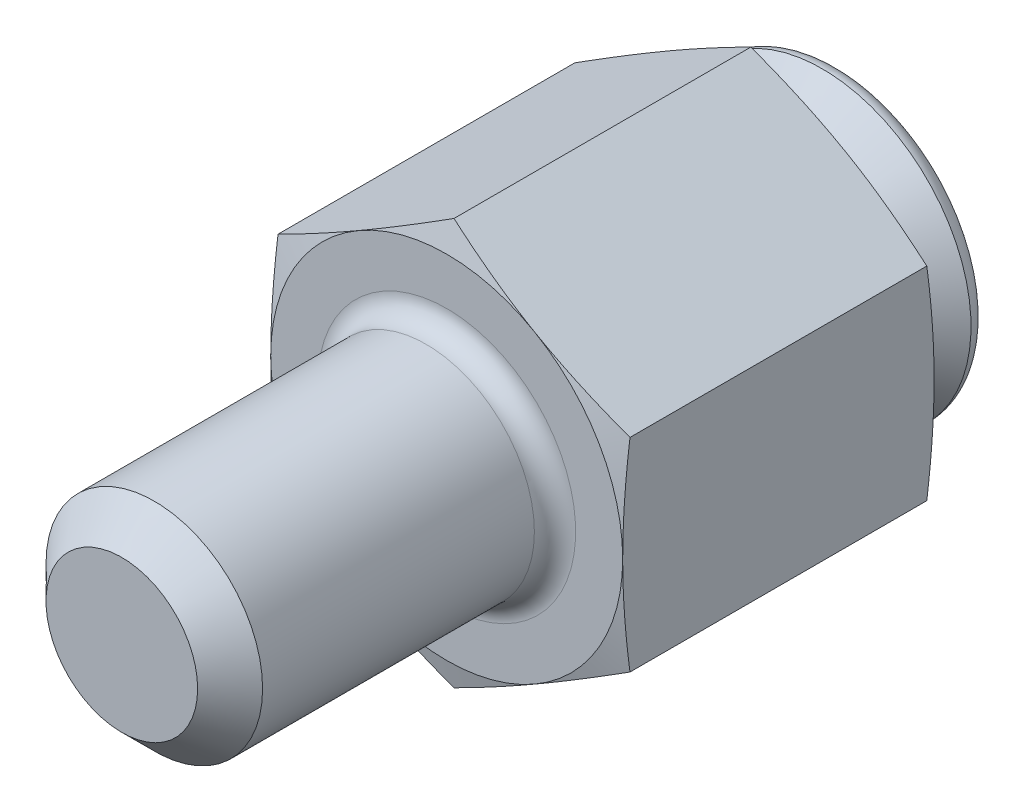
ISO-10303-21;
HEADER;
FILE_DESCRIPTION(('STEP AP214'),'2;1');
FILE_NAME('part.step','',(''),(''),'','','');
FILE_SCHEMA(('AUTOMOTIVE_DESIGN { 1 0 10303 214 1 1 1 1 }'));
ENDSEC;
DATA;
#1=APPLICATION_CONTEXT('core data for automotive mechanical design processes');
#2=APPLICATION_PROTOCOL_DEFINITION('international standard','automotive_design',2000,#1);
#3=PRODUCT_CONTEXT('',#1,'mechanical');
#4=PRODUCT('Part','Part','',(#3));
#5=PRODUCT_RELATED_PRODUCT_CATEGORY('part','',(#4));
#6=PRODUCT_DEFINITION_FORMATION('','',#4);
#7=PRODUCT_DEFINITION_CONTEXT('part definition',#1,'design');
#8=PRODUCT_DEFINITION('design','',#6,#7);
#9=PRODUCT_DEFINITION_SHAPE('','',#8);
#10=(LENGTH_UNIT() NAMED_UNIT(*) SI_UNIT(.MILLI.,.METRE.));
#11=(NAMED_UNIT(*) PLANE_ANGLE_UNIT() SI_UNIT($,.RADIAN.));
#12=(NAMED_UNIT(*) SI_UNIT($,.STERADIAN.) SOLID_ANGLE_UNIT());
#13=UNCERTAINTY_MEASURE_WITH_UNIT(LENGTH_MEASURE(1.E-05),#10,'distance_accuracy_value','');
#14=(GEOMETRIC_REPRESENTATION_CONTEXT(3) GLOBAL_UNCERTAINTY_ASSIGNED_CONTEXT((#13)) GLOBAL_UNIT_ASSIGNED_CONTEXT((#10,
#11,#12)) REPRESENTATION_CONTEXT('',''));
#15=CARTESIAN_POINT('',(0.,0.,0.));
#16=DIRECTION('',(0.,0.,1.));
#17=DIRECTION('',(1.,0.,0.));
#18=AXIS2_PLACEMENT_3D('',#15,#16,#17);
#19=CARTESIAN_POINT('',(0.,0.,6.5013999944));
#20=DIRECTION('',(0.,0.,-1.));
#21=DIRECTION('',(-0.250229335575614,0.968186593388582,0.));
#22=AXIS2_PLACEMENT_3D('',#19,#20,#21);
#23=SPHERICAL_SURFACE('',#22,5.);
#24=CARTESIAN_POINT('',(0.,0.,4.2191999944));
#25=DIRECTION('',(0.,0.,-1.));
#26=DIRECTION('',(-0.968186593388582,-0.250229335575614,0.));
#27=AXIS2_PLACEMENT_3D('',#24,#25,#26);
#28=CIRCLE('',#27,4.44877097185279);
#29=CARTESIAN_POINT('',(-1.1132130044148,4.30724041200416,4.2191999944));
#30=VERTEX_POINT('',#29);
#31=EDGE_CURVE('E9',#30,#30,#28,.F.);
#32=CARTESIAN_POINT('',(0.,0.,3.56696480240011));
#33=DIRECTION('',(0.,0.,1.));
#34=DIRECTION('',(-0.250229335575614,0.968186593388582,0.));
#35=AXIS2_PLACEMENT_3D('',#32,#33,#34);
#36=CIRCLE('',#35,4.04834411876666);
#37=CARTESIAN_POINT('',(-1.01301445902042,3.91955250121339,3.56696480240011));
#38=VERTEX_POINT('',#37);
#39=EDGE_CURVE('E280',#38,#38,#36,.T.);
#40=CARTESIAN_POINT('',(-1.1132130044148,4.30724041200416,4.2191999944));
#41=CARTESIAN_POINT('',(-1.11230155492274,4.30371383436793,4.21209962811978));
#42=CARTESIAN_POINT('',(-1.11138585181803,4.30017079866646,4.20500798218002));
#43=CARTESIAN_POINT('',(-1.10954595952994,4.29305189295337,4.19084229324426));
#44=CARTESIAN_POINT('',(-1.10862177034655,4.28947602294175,4.18376825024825));
#45=CARTESIAN_POINT('',(-1.10676492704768,4.2822915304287,4.16963792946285));
#46=CARTESIAN_POINT('',(-1.1058322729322,4.27868290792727,4.16258165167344));
#47=CARTESIAN_POINT('',(-1.10395852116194,4.27143299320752,4.14848702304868));
#48=CARTESIAN_POINT('',(-1.10301742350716,4.26779170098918,4.14144867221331));
#49=CARTESIAN_POINT('',(-1.10112680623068,4.26047653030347,4.12739005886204));
#50=CARTESIAN_POINT('',(-1.10017728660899,4.25680265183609,4.12036979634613));
#51=CARTESIAN_POINT('',(-1.09826984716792,4.24942239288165,4.10634752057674));
#52=CARTESIAN_POINT('',(-1.09731192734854,4.24571601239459,4.09934550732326));
#53=CARTESIAN_POINT('',(-1.09538770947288,4.23827083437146,4.08535989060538));
#54=CARTESIAN_POINT('',(-1.09442141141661,4.23453203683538,4.07837628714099));
#55=CARTESIAN_POINT('',(-1.0924804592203,4.22702211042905,4.06442765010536));
#56=CARTESIAN_POINT('',(-1.09150580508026,4.22325098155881,4.05746261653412));
#57=CARTESIAN_POINT('',(-1.08954816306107,4.21567647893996,4.04355127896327));
#58=CARTESIAN_POINT('',(-1.08856517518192,4.21187310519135,4.03660497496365));
#59=CARTESIAN_POINT('',(-1.08659088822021,4.2042342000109,4.0227312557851));
#60=CARTESIAN_POINT('',(-1.08559958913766,4.20039866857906,4.01580384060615));
#61=CARTESIAN_POINT('',(-1.08360870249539,4.19269553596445,4.00196805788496));
#62=CARTESIAN_POINT('',(-1.08260911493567,4.1888279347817,3.99505969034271));
#63=CARTESIAN_POINT('',(-1.08060167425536,4.18106075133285,3.98126216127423));
#64=CARTESIAN_POINT('',(-1.07959382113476,4.17716116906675,3.97437299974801));
#65=CARTESIAN_POINT('',(-1.07756987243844,4.16933011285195,3.96061404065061));
#66=CARTESIAN_POINT('',(-1.07655377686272,4.16539863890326,3.95374424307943));
#67=CARTESIAN_POINT('',(-1.07451336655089,4.15750388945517,3.94002416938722));
#68=CARTESIAN_POINT('',(-1.07348905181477,4.15354061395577,3.93317389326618));
#69=CARTESIAN_POINT('',(-1.0714322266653,4.14558235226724,3.91949301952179));
#70=CARTESIAN_POINT('',(-1.07039971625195,4.14158736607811,3.91266242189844));
#71=CARTESIAN_POINT('',(-1.06832652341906,4.13356577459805,3.89902106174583));
#72=CARTESIAN_POINT('',(-1.06728584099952,4.12953916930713,3.89221029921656));
#73=CARTESIAN_POINT('',(-1.06519632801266,4.12145443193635,3.8786087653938));
#74=CARTESIAN_POINT('',(-1.06414749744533,4.11739629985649,3.8718179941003));
#75=CARTESIAN_POINT('',(-1.0620417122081,4.10924860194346,3.8582565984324));
#76=CARTESIAN_POINT('',(-1.06098475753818,4.10515903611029,3.85148597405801));
#77=CARTESIAN_POINT('',(-1.05886274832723,4.09694856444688,3.83796502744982));
#78=CARTESIAN_POINT('',(-1.05779769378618,4.09282765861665,3.83121470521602));
#79=CARTESIAN_POINT('',(-1.0556595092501,4.08455460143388,3.81773451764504));
#80=CARTESIAN_POINT('',(-1.05458637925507,4.08040245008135,3.81100465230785));
#81=CARTESIAN_POINT('',(-1.0524320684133,4.07206699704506,3.79756553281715));
#82=CARTESIAN_POINT('',(-1.05135088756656,4.06788369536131,3.79085627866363));
#83=CARTESIAN_POINT('',(-1.04918049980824,4.0594860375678,3.77745853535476));
#84=CARTESIAN_POINT('',(-1.04809129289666,4.05527168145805,3.77077004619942));
#85=CARTESIAN_POINT('',(-1.0459048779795,4.04681201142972,3.75741398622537));
#86=CARTESIAN_POINT('',(-1.04480766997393,4.04256669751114,3.75074641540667));
#87=CARTESIAN_POINT('',(-1.04260527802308,4.03404520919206,3.7374323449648));
#88=CARTESIAN_POINT('',(-1.0415000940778,4.02976903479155,3.73078584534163));
#89=CARTESIAN_POINT('',(-1.03928177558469,4.021185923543,3.71751406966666));
#90=CARTESIAN_POINT('',(-1.03816864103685,4.01687898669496,3.71088879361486));
#91=CARTESIAN_POINT('',(-1.03593444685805,4.00823444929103,3.69765961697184));
#92=CARTESIAN_POINT('',(-1.03481338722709,4.00389684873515,3.69105571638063));
#93=CARTESIAN_POINT('',(-1.03256336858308,3.99519108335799,3.67786944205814));
#94=CARTESIAN_POINT('',(-1.03143440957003,3.99082291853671,3.67128706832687));
#95=CARTESIAN_POINT('',(-1.02916861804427,3.98205612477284,3.65814399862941));
#96=CARTESIAN_POINT('',(-1.02803178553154,3.97765749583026,3.65158330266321));
#97=CARTESIAN_POINT('',(-1.0257502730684,3.96882987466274,3.63848373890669));
#98=CARTESIAN_POINT('',(-1.02460559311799,3.96440088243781,3.63194487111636));
#99=CARTESIAN_POINT('',(-1.02230841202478,3.95551263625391,3.61888911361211));
#100=CARTESIAN_POINT('',(-1.02115591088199,3.95105338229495,3.61237222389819));
#101=CARTESIAN_POINT('',(-1.01884311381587,3.94210471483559,3.59936057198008));
#102=CARTESIAN_POINT('',(-1.01768281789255,3.93761530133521,3.5928658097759));
#103=CARTESIAN_POINT('',(-1.01535445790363,3.92860641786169,3.57989856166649));
#104=CARTESIAN_POINT('',(-1.01418639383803,3.92408694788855,3.57342607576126));
#105=CARTESIAN_POINT('',(-1.01301445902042,3.91955250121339,3.56696480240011));
#106=B_SPLINE_CURVE_WITH_KNOTS('',3,(#40,#41,#42,#43,#44,#45,#46,#47,#48,#49,#50,#51,#52,#53,
#54,#55,#56,#57,#58,#59,#60,#61,#62,#63,#64,#65,#66,#67,#68,#69,#70,#71,#72,#73,#74,#75,#76,#77,
#78,#79,#80,#81,#82,#83,#84,#85,#86,#87,#88,#89,#90,#91,#92,#93,#94,#95,#96,#97,#98,#99,#100,
#101,#102,#103,#104,#105),.UNSPECIFIED.,.F.,.F.,(4,2,2,2,2,2,2,2,2,2,2,2,2,2,2,2,2,2,2,2,2,2,2,
2,2,2,2,2,2,2,2,2,4),(0.,0.0239404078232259,0.0478808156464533,0.0718212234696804,
0.0957616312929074,0.119702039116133,0.14364244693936,0.167582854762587,0.191523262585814,
0.21546367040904,0.239404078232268,0.263344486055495,0.287284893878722,0.311225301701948,
0.335165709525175,0.359106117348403,0.383046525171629,0.406986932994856,0.430927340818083,
0.454867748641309,0.478808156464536,0.502748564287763,0.52668897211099,0.550629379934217,
0.574569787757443,0.59851019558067,0.622450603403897,0.646391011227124,0.67033141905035,
0.694271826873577,0.718212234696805,0.742152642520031,0.766093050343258),.UNSPECIFIED.);
#107=EDGE_CURVE('BSEAM14',#30,#38,#106,.T.);
#108=ORIENTED_EDGE('',*,*,#31,.F.);
#109=ORIENTED_EDGE('',*,*,#39,.T.);
#110=ORIENTED_EDGE('',*,*,#107,.T.);
#111=ORIENTED_EDGE('',*,*,#107,.F.);
#112=EDGE_LOOP('',(#108,#110,#109,#111));
#113=FACE_BOUND('',#112,.T.);
#114=ADVANCED_FACE('F14',(#113),#23,.T.);
#115=CARTESIAN_POINT('',(0.,0.,0.));
#116=DIRECTION('',(0.,0.,-1.));
#117=DIRECTION('',(0.250229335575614,-0.968186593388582,0.));
#118=AXIS2_PLACEMENT_3D('',#115,#116,#117);
#119=CYLINDRICAL_SURFACE('',#118,4.);
#120=CARTESIAN_POINT('',(0.,0.,3.41789549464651));
#121=DIRECTION('',(0.,0.,1.));
#122=DIRECTION('',(-0.250229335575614,0.968186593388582,0.));
#123=AXIS2_PLACEMENT_3D('',#120,#121,#122);
#124=CIRCLE('',#123,4.);
#125=CARTESIAN_POINT('',(-1.00091734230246,3.87274637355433,3.41789549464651));
#126=VERTEX_POINT('',#125);
#127=EDGE_CURVE('E278',#126,#126,#124,.F.);
#128=ORIENTED_EDGE('',*,*,#127,.T.);
#129=EDGE_LOOP('',(#128));
#130=FACE_BOUND('',#129,.T.);
#131=CARTESIAN_POINT('',(0.,0.,2.24021024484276));
#132=DIRECTION('',(0.,0.,-1.));
#133=DIRECTION('',(0.250229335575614,-0.968186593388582,0.));
#134=AXIS2_PLACEMENT_3D('',#131,#132,#133);
#135=CIRCLE('',#134,4.);
#136=CARTESIAN_POINT('',(1.00091734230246,-3.87274637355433,2.24021024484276));
#137=VERTEX_POINT('',#136);
#138=EDGE_CURVE('E275',#137,#137,#135,.F.);
#139=ORIENTED_EDGE('',*,*,#138,.T.);
#140=EDGE_LOOP('',(#139));
#141=FACE_BOUND('',#140,.T.);
#142=ADVANCED_FACE('F299',(#130,#141),#119,.T.);
#143=CARTESIAN_POINT('',(0.,0.,2.135));
#144=DIRECTION('',(0.,0.,-1.));
#145=DIRECTION('',(0.250229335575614,-0.968186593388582,0.));
#146=AXIS2_PLACEMENT_3D('',#143,#144,#145);
#147=CONICAL_SURFACE('',#146,4.,0.78539816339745);
#148=CARTESIAN_POINT('',(0.,0.,2.06060512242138));
#149=DIRECTION('',(0.,0.,-1.));
#150=DIRECTION('',(0.250229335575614,-0.968186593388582,0.));
#151=AXIS2_PLACEMENT_3D('',#148,#149,#150);
#152=CIRCLE('',#151,4.07439487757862);
#153=CARTESIAN_POINT('',(1.01953312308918,-3.94477449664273,2.06060512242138));
#154=VERTEX_POINT('',#153);
#155=EDGE_CURVE('E18',#154,#154,#152,.T.);
#156=ORIENTED_EDGE('',*,*,#155,.T.);
#157=EDGE_LOOP('',(#156));
#158=FACE_BOUND('',#157,.T.);
#159=CARTESIAN_POINT('',(0.,0.,0.635));
#160=DIRECTION('',(0.,0.,-1.));
#161=DIRECTION('',(0.250229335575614,-0.968186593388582,0.));
#162=AXIS2_PLACEMENT_3D('',#159,#160,#161);
#163=CIRCLE('',#162,5.5);
#164=CARTESIAN_POINT('',(1.37626134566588,-5.3250262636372,0.635));
#165=VERTEX_POINT('',#164);
#166=EDGE_CURVE('E269',#165,#165,#163,.T.);
#167=ORIENTED_EDGE('',*,*,#166,.F.);
#168=EDGE_LOOP('',(#167));
#169=FACE_BOUND('',#168,.T.);
#170=ADVANCED_FACE('F305',(#158,#169),#147,.T.);
#171=CARTESIAN_POINT('',(-1.37626134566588,5.3250262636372,0.));
#172=DIRECTION('',(0.,0.,1.));
#173=DIRECTION('',(-0.250229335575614,0.968186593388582,0.));
#174=AXIS2_PLACEMENT_3D('',#171,#172,#173);
#175=PLANE('',#174);
#176=CARTESIAN_POINT('',(0.,0.,0.));
#177=DIRECTION('',(0.,0.,1.));
#178=DIRECTION('',(-0.250229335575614,0.968186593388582,0.));
#179=AXIS2_PLACEMENT_3D('',#176,#177,#178);
#180=CIRCLE('',#179,4.865);
#181=CARTESIAN_POINT('',(-1.21736571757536,4.71022777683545,0.));
#182=VERTEX_POINT('',#181);
#183=EDGE_CURVE('E272',#182,#182,#180,.F.);
#184=ORIENTED_EDGE('',*,*,#183,.T.);
#185=EDGE_LOOP('',(#184));
#186=FACE_BOUND('',#185,.T.);
#187=ADVANCED_FACE('F347',(#186),#175,.F.);
#188=CARTESIAN_POINT('',(0.,0.,0.635));
#189=DIRECTION('',(0.,0.,1.));
#190=DIRECTION('',(-0.250229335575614,0.968186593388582,0.));
#191=AXIS2_PLACEMENT_3D('',#188,#189,#190);
#192=TOROIDAL_SURFACE('',#191,4.865,0.635);
#193=ORIENTED_EDGE('',*,*,#166,.T.);
#194=EDGE_LOOP('',(#193));
#195=FACE_BOUND('',#194,.T.);
#196=ORIENTED_EDGE('',*,*,#183,.F.);
#197=EDGE_LOOP('',(#196));
#198=FACE_BOUND('',#197,.T.);
#199=ADVANCED_FACE('F350',(#195,#198),#192,.T.);
#200=CARTESIAN_POINT('',(0.,0.,3.41789549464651));
#201=DIRECTION('',(0.,0.,1.));
#202=DIRECTION('',(-0.250229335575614,0.968186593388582,0.));
#203=AXIS2_PLACEMENT_3D('',#200,#201,#202);
#204=TOROIDAL_SURFACE('',#203,4.254,0.254);
#205=ORIENTED_EDGE('',*,*,#39,.F.);
#206=EDGE_LOOP('',(#205));
#207=FACE_BOUND('',#206,.T.);
#208=ORIENTED_EDGE('',*,*,#127,.F.);
#209=EDGE_LOOP('',(#208));
#210=FACE_BOUND('',#209,.T.);
#211=ADVANCED_FACE('F321',(#207,#210),#204,.F.);
#212=CARTESIAN_POINT('',(0.,0.,2.24021024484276));
#213=DIRECTION('',(0.,0.,-1.));
#214=DIRECTION('',(0.250229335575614,-0.968186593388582,0.));
#215=AXIS2_PLACEMENT_3D('',#212,#213,#214);
#216=TOROIDAL_SURFACE('',#215,4.254,0.254);
#217=ORIENTED_EDGE('',*,*,#138,.F.);
#218=EDGE_LOOP('',(#217));
#219=FACE_BOUND('',#218,.T.);
#220=ORIENTED_EDGE('',*,*,#155,.F.);
#221=EDGE_LOOP('',(#220));
#222=FACE_BOUND('',#221,.T.);
#223=ADVANCED_FACE('F16',(#219,#222),#216,.F.);
#224=CARTESIAN_POINT('',(0.,0.,26.4999999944));
#225=DIRECTION('',(0.,0.,1.));
#226=DIRECTION('',(1.,0.,0.));
#227=AXIS2_PLACEMENT_3D('',#224,#225,#226);
#228=PLANE('',#227);
#229=CARTESIAN_POINT('',(0.,0.,26.4999999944));
#230=DIRECTION('',(0.,0.,1.));
#231=DIRECTION('',(1.,0.,0.));
#232=AXIS2_PLACEMENT_3D('',#229,#230,#231);
#233=CIRCLE('',#232,2.8);
#234=CARTESIAN_POINT('',(2.8,0.,26.4999999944));
#235=VERTEX_POINT('',#234);
#236=EDGE_CURVE('E264',#235,#235,#233,.T.);
#237=ORIENTED_EDGE('',*,*,#236,.T.);
#238=EDGE_LOOP('',(#237));
#239=FACE_BOUND('',#238,.T.);
#240=ADVANCED_FACE('F309',(#239),#228,.T.);
#241=CARTESIAN_POINT('',(0.,0.,26.4999999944));
#242=DIRECTION('',(0.,0.,-1.));
#243=DIRECTION('',(-1.,0.,0.));
#244=AXIS2_PLACEMENT_3D('',#241,#242,#243);
#245=CONICAL_SURFACE('',#244,2.8,0.785398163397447);
#246=CARTESIAN_POINT('',(0.,0.,25.2999999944));
#247=DIRECTION('',(0.,0.,1.));
#248=DIRECTION('',(1.,0.,0.));
#249=AXIS2_PLACEMENT_3D('',#246,#247,#248);
#250=CIRCLE('',#249,4.);
#251=CARTESIAN_POINT('',(4.,0.,25.2999999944));
#252=VERTEX_POINT('',#251);
#253=EDGE_CURVE('E23',#252,#252,#250,.F.);
#254=ORIENTED_EDGE('',*,*,#253,.F.);
#255=EDGE_LOOP('',(#254));
#256=FACE_BOUND('',#255,.T.);
#257=ORIENTED_EDGE('',*,*,#236,.F.);
#258=EDGE_LOOP('',(#257));
#259=FACE_BOUND('',#258,.T.);
#260=ADVANCED_FACE('F311',(#256,#259),#245,.T.);
#261=CARTESIAN_POINT('',(0.,0.,26.4999999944));
#262=DIRECTION('',(0.,0.,-1.));
#263=DIRECTION('',(-1.,0.,0.));
#264=AXIS2_PLACEMENT_3D('',#261,#262,#263);
#265=CYLINDRICAL_SURFACE('',#264,4.);
#266=ORIENTED_EDGE('',*,*,#253,.T.);
#267=EDGE_LOOP('',(#266));
#268=FACE_BOUND('',#267,.T.);
#269=CARTESIAN_POINT('',(0.,0.,15.2619999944));
#270=DIRECTION('',(0.,0.,-1.));
#271=DIRECTION('',(-1.,0.,0.));
#272=AXIS2_PLACEMENT_3D('',#269,#270,#271);
#273=CIRCLE('',#272,4.);
#274=CARTESIAN_POINT('',(-4.,0.,15.2619999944));
#275=VERTEX_POINT('',#274);
#276=EDGE_CURVE('E258',#275,#275,#273,.F.);
#277=ORIENTED_EDGE('',*,*,#276,.T.);
#278=EDGE_LOOP('',(#277));
#279=FACE_BOUND('',#278,.T.);
#280=ADVANCED_FACE('F318',(#268,#279),#265,.T.);
#281=CARTESIAN_POINT('',(0.,0.,15.2619999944));
#282=DIRECTION('',(0.,0.,-1.));
#283=DIRECTION('',(-1.,0.,0.));
#284=AXIS2_PLACEMENT_3D('',#281,#282,#283);
#285=TOROIDAL_SURFACE('',#284,4.762,0.762);
#286=CARTESIAN_POINT('',(0.,0.,14.4999999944));
#287=DIRECTION('',(0.,0.,-1.));
#288=DIRECTION('',(-1.,0.,0.));
#289=AXIS2_PLACEMENT_3D('',#286,#287,#288);
#290=CIRCLE('',#289,4.762);
#291=CARTESIAN_POINT('',(-4.762,0.,14.4999999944));
#292=VERTEX_POINT('',#291);
#293=EDGE_CURVE('E261',#292,#292,#290,.T.);
#294=ORIENTED_EDGE('',*,*,#293,.F.);
#295=EDGE_LOOP('',(#294));
#296=FACE_BOUND('',#295,.T.);
#297=ORIENTED_EDGE('',*,*,#276,.F.);
#298=EDGE_LOOP('',(#297));
#299=FACE_BOUND('',#298,.T.);
#300=ADVANCED_FACE('F324',(#296,#299),#285,.F.);
#301=CARTESIAN_POINT('',(-6.5,3.75277674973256,14.4999999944));
#302=DIRECTION('',(0.,0.,-1.));
#303=DIRECTION('',(-1.,0.,0.));
#304=AXIS2_PLACEMENT_3D('',#301,#302,#303);
#305=PLANE('',#304);
#306=CARTESIAN_POINT('',(0.,0.,14.4999999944));
#307=DIRECTION('',(0.,0.,-1.));
#308=DIRECTION('',(-1.,0.,0.));
#309=AXIS2_PLACEMENT_3D('',#306,#307,#308);
#310=CIRCLE('',#309,6.5);
#311=CARTESIAN_POINT('',(-6.5,0.,14.4999999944));
#312=VERTEX_POINT('',#311);
#313=CARTESIAN_POINT('',(-3.25,5.62916512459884,14.4999999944));
#314=VERTEX_POINT('',#313);
#315=EDGE_CURVE('E624',#312,#314,#310,.T.);
#316=ORIENTED_EDGE('',*,*,#315,.F.);
#317=CARTESIAN_POINT('',(0.,0.,14.4999999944));
#318=DIRECTION('',(0.,0.,-1.));
#319=DIRECTION('',(-1.,0.,0.));
#320=AXIS2_PLACEMENT_3D('',#317,#318,#319);
#321=CIRCLE('',#320,6.5);
#322=CARTESIAN_POINT('',(-3.25,-5.62916512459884,14.4999999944));
#323=VERTEX_POINT('',#322);
#324=EDGE_CURVE('E235',#323,#312,#321,.T.);
#325=ORIENTED_EDGE('',*,*,#324,.F.);
#326=CARTESIAN_POINT('',(3.25,-5.62916512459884,14.4999999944));
#327=VERTEX_POINT('',#326);
#328=EDGE_CURVE('E249',#327,#323,#321,.T.);
#329=ORIENTED_EDGE('',*,*,#328,.F.);
#330=CARTESIAN_POINT('',(6.5,0.,14.4999999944));
#331=VERTEX_POINT('',#330);
#332=EDGE_CURVE('E670',#331,#327,#321,.T.);
#333=ORIENTED_EDGE('',*,*,#332,.F.);
#334=CARTESIAN_POINT('',(3.25,5.62916512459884,14.4999999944));
#335=VERTEX_POINT('',#334);
#336=EDGE_CURVE('E672',#335,#331,#321,.T.);
#337=ORIENTED_EDGE('',*,*,#336,.F.);
#338=EDGE_CURVE('E250',#314,#335,#321,.T.);
#339=ORIENTED_EDGE('',*,*,#338,.F.);
#340=EDGE_LOOP('',(#316,#325,#329,#333,#337,#339));
#341=FACE_BOUND('',#340,.T.);
#342=ORIENTED_EDGE('',*,*,#293,.T.);
#343=EDGE_LOOP('',(#342));
#344=FACE_BOUND('',#343,.T.);
#345=ADVANCED_FACE('F329',(#341,#344),#305,.F.);
#346=CARTESIAN_POINT('',(0.,0.,13.0858363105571));
#347=DIRECTION('',(0.,0.,-1.));
#348=DIRECTION('',(-1.,0.,0.));
#349=AXIS2_PLACEMENT_3D('',#346,#347,#348);
#350=CONICAL_SURFACE('',#349,11.7777307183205,1.30899693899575);
#351=CARTESIAN_POINT('',(6.5,-10.0044654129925,13.0448738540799));
#352=CARTESIAN_POINT('',(6.50000000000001,-9.70867848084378,13.1113166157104));
#353=CARTESIAN_POINT('',(6.50000000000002,-9.41270865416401,13.1769595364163));
#354=CARTESIAN_POINT('',(6.50000000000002,-8.82031321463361,13.3062138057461));
#355=CARTESIAN_POINT('',(6.50000000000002,-8.523887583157,13.3698250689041));
#356=CARTESIAN_POINT('',(6.50000000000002,-7.9302364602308,13.4946371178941));
#357=CARTESIAN_POINT('',(6.50000000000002,-7.63301047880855,13.5558355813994));
#358=CARTESIAN_POINT('',(6.50000000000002,-7.03794541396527,13.6751737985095));
#359=CARTESIAN_POINT('',(6.50000000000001,-6.74010633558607,13.7333135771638));
#360=CARTESIAN_POINT('',(6.50000000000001,-6.14610081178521,13.84535276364));
#361=CARTESIAN_POINT('',(6.50000000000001,-5.8499401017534,13.8992824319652));
#362=CARTESIAN_POINT('',(6.50000000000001,-5.25681519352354,14.0025175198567));
#363=CARTESIAN_POINT('',(6.50000000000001,-4.95985101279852,14.0518230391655));
#364=CARTESIAN_POINT('',(6.50000000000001,-4.36505179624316,14.1447161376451));
#365=CARTESIAN_POINT('',(6.50000000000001,-4.06721684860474,14.1883042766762));
#366=CARTESIAN_POINT('',(6.50000000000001,-3.47059684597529,14.2684922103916));
#367=CARTESIAN_POINT('',(6.5,-3.17181178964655,14.3050919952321));
#368=CARTESIAN_POINT('',(6.5,-2.56988519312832,14.3702843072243));
#369=CARTESIAN_POINT('',(6.50000000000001,-2.26673301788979,14.3987800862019));
#370=CARTESIAN_POINT('',(6.50000000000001,-1.65965008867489,14.4458085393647));
#371=CARTESIAN_POINT('',(6.50000000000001,-1.3557193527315,14.46434144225));
#372=CARTESIAN_POINT('',(6.50000000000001,-0.747523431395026,14.4903642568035));
#373=CARTESIAN_POINT('',(6.50000000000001,-0.443258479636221,14.49785951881));
#374=CARTESIAN_POINT('',(6.50000000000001,0.165338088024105,14.5013445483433));
#375=CARTESIAN_POINT('',(6.50000000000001,0.469669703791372,14.4973343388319));
#376=CARTESIAN_POINT('',(6.5,1.07910960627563,14.4780322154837));
#377=CARTESIAN_POINT('',(6.5,1.3842165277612,14.4626980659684));
#378=CARTESIAN_POINT('',(6.5,1.99372315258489,14.421629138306));
#379=CARTESIAN_POINT('',(6.5,2.29812283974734,14.3958941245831));
#380=CARTESIAN_POINT('',(6.5,2.90621194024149,14.3353423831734));
#381=CARTESIAN_POINT('',(6.5,3.20990073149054,14.3005195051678));
#382=CARTESIAN_POINT('',(6.5,3.8162976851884,14.2232646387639));
#383=CARTESIAN_POINT('',(6.5,4.11900584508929,14.1808326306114));
#384=CARTESIAN_POINT('',(6.5,4.71530607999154,14.0909709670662));
#385=CARTESIAN_POINT('',(6.5,5.00892342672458,14.0437073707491));
#386=CARTESIAN_POINT('',(6.5,5.59535016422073,13.9443851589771));
#387=CARTESIAN_POINT('',(6.5,5.88815952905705,13.8923263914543));
#388=CARTESIAN_POINT('',(6.5,6.47308937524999,13.7843266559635));
#389=CARTESIAN_POINT('',(6.5,6.76520978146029,13.7283852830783));
#390=CARTESIAN_POINT('',(6.49999999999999,7.3488323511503,13.6133576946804));
#391=CARTESIAN_POINT('',(6.49999999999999,7.64033450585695,13.5542714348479));
#392=CARTESIAN_POINT('',(6.49999999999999,8.51421406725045,13.3731782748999));
#393=CARTESIAN_POINT('',(6.49999999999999,9.0958022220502,13.2473677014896));
#394=CARTESIAN_POINT('',(6.49999999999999,10.2574156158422,12.9889787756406));
#395=CARTESIAN_POINT('',(6.49999999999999,10.8374409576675,12.8564008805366));
#396=CARTESIAN_POINT('',(6.49999999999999,11.9903925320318,12.5879282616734));
#397=CARTESIAN_POINT('',(6.49999999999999,12.5633300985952,12.452082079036));
#398=CARTESIAN_POINT('',(6.49999999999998,13.7084200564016,12.1770780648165));
#399=CARTESIAN_POINT('',(6.49999999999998,14.2805724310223,12.0379201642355));
#400=CARTESIAN_POINT('',(6.49999999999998,15.4235044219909,11.7573669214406));
#401=CARTESIAN_POINT('',(6.49999999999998,15.9942848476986,11.6159748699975));
#402=CARTESIAN_POINT('',(6.49999999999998,17.1353614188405,11.3313338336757));
#403=CARTESIAN_POINT('',(6.49999999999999,17.7056575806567,11.1880849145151));
#404=CARTESIAN_POINT('',(6.5,18.2757873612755,11.0441847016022));
#405=B_SPLINE_CURVE_WITH_KNOTS('',3,(#351,#352,#353,#354,#355,#356,#357,#358,#359,#360,#361,
#362,#363,#364,#365,#366,#367,#368,#369,#370,#371,#372,#373,#374,#375,#376,#377,#378,#379,#380,
#381,#382,#383,#384,#385,#386,#387,#388,#389,#390,#391,#392,#393,#394,#395,#396,#397,#398,#399,
#400,#401,#402,#403,#404),.UNSPECIFIED.,.F.,.F.,(4,2,2,2,2,2,2,2,2,2,2,2,2,2,2,2,2,2,2,2,2,2,2,
2,2,2,4),(0.,0.909476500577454,1.81899120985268,2.72936096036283,3.63972325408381,
4.54278656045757,5.44583038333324,6.34878571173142,7.25174231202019,8.16506499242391,
9.07836670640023,9.991225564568,10.9040826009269,11.8203616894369,12.7366615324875,
13.6535831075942,14.5705070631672,15.4626502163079,16.3548216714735,17.2470863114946,
18.1393635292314,19.9244135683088,21.7093431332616,23.4757957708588,25.2422852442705,
27.0063787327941,28.7704099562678),.UNSPECIFIED.);
#406=CARTESIAN_POINT('',(6.5,-3.75277674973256,14.230562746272));
#407=VERTEX_POINT('',#406);
#408=EDGE_CURVE('E231',#331,#407,#405,.F.);
#409=ORIENTED_EDGE('',*,*,#408,.F.);
#410=ORIENTED_EDGE('',*,*,#332,.T.);
#411=CARTESIAN_POINT('',(6.5002,-3.75266127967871,14.2305318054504));
#412=CARTESIAN_POINT('',(6.23025475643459,-3.90851423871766,14.272310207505));
#413=CARTESIAN_POINT('',(5.95982006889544,-4.06464977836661,14.3102381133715));
#414=CARTESIAN_POINT('',(5.41799562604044,-4.37747226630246,14.3768739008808));
#415=CARTESIAN_POINT('',(5.14660552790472,-4.53415941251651,14.4055780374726));
#416=CARTESIAN_POINT('',(4.60451571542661,-4.84713511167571,14.4520905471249));
#417=CARTESIAN_POINT('',(4.33381966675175,-5.0034215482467,14.4699543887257));
#418=CARTESIAN_POINT('',(3.79208236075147,-5.31619372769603,14.4939079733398));
#419=CARTESIAN_POINT('',(3.52104118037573,-5.47267942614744,14.4999999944));
#420=CARTESIAN_POINT('',(2.97895881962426,-5.78565082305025,14.4999999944));
#421=CARTESIAN_POINT('',(2.70791763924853,-5.94213652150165,14.4939079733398));
#422=CARTESIAN_POINT('',(2.16618033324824,-6.25490870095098,14.4699543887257));
#423=CARTESIAN_POINT('',(1.89548428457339,-6.41119513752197,14.4520905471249));
#424=CARTESIAN_POINT('',(1.35339447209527,-6.72417083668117,14.4055780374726));
#425=CARTESIAN_POINT('',(1.08200437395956,-6.88085798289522,14.3768739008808));
#426=CARTESIAN_POINT('',(0.540179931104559,-7.19368047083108,14.3102381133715));
#427=CARTESIAN_POINT('',(0.269745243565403,-7.34981601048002,14.272310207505));
#428=CARTESIAN_POINT('',(-0.000200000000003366,-7.50566896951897,14.2305318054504));
#429=B_SPLINE_CURVE_WITH_KNOTS('',3,(#411,#412,#413,#414,#415,#416,#417,#418,#419,#420,#421,
#422,#423,#424,#425,#426,#427,#428),.UNSPECIFIED.,.F.,.F.,(4,2,2,2,2,2,2,2,4),(0.,
0.943529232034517,1.88744107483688,2.82648138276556,3.76533995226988,4.7041985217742,
5.64323882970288,6.58715067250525,7.53067990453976),.UNSPECIFIED.);
#430=EDGE_CURVE('E230',#407,#327,#429,.T.);
#431=ORIENTED_EDGE('',*,*,#430,.F.);
#432=EDGE_LOOP('',(#409,#410,#431));
#433=FACE_BOUND('',#432,.T.);
#434=ADVANCED_FACE('F341',(#433),#350,.T.);
#435=CARTESIAN_POINT('',(-0.000200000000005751,7.50566896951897,14.2305318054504));
#436=CARTESIAN_POINT('',(0.269745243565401,7.34981601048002,14.272310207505));
#437=CARTESIAN_POINT('',(0.540179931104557,7.19368047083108,14.3102381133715));
#438=CARTESIAN_POINT('',(1.08200437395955,6.88085798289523,14.3768739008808));
#439=CARTESIAN_POINT('',(1.35339447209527,6.72417083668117,14.4055780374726));
#440=CARTESIAN_POINT('',(1.89548428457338,6.41119513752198,14.4520905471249));
#441=CARTESIAN_POINT('',(2.16618033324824,6.25490870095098,14.4699543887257));
#442=CARTESIAN_POINT('',(2.70791763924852,5.94213652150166,14.4939079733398));
#443=CARTESIAN_POINT('',(2.97895881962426,5.78565082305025,14.4999999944));
#444=CARTESIAN_POINT('',(3.52104118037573,5.47267942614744,14.4999999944));
#445=CARTESIAN_POINT('',(3.79208236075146,5.31619372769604,14.4939079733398));
#446=CARTESIAN_POINT('',(4.33381966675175,5.00342154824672,14.4699543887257));
#447=CARTESIAN_POINT('',(4.6045157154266,4.84713511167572,14.4520905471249));
#448=CARTESIAN_POINT('',(5.14660552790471,4.53415941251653,14.4055780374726));
#449=CARTESIAN_POINT('',(5.41799562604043,4.37747226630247,14.3768739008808));
#450=CARTESIAN_POINT('',(5.95982006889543,4.06464977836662,14.3102381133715));
#451=CARTESIAN_POINT('',(6.23025475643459,3.90851423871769,14.272310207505));
#452=CARTESIAN_POINT('',(6.5002,3.75266127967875,14.2305318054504));
#453=B_SPLINE_CURVE_WITH_KNOTS('',3,(#435,#436,#437,#438,#439,#440,#441,#442,#443,#444,#445,
#446,#447,#448,#449,#450,#451,#452),.UNSPECIFIED.,.F.,.F.,(4,2,2,2,2,2,2,2,4),(0.,
0.943529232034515,1.88744107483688,2.82648138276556,3.76533995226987,4.70419852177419,
5.64323882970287,6.58715067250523,7.53067990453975),.UNSPECIFIED.);
#454=CARTESIAN_POINT('',(6.5,3.75277674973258,14.230562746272));
#455=VERTEX_POINT('',#454);
#456=EDGE_CURVE('E643',#335,#455,#453,.T.);
#457=ORIENTED_EDGE('',*,*,#456,.F.);
#458=ORIENTED_EDGE('',*,*,#336,.T.);
#459=EDGE_CURVE('E217',#455,#331,#405,.F.);
#460=ORIENTED_EDGE('',*,*,#459,.F.);
#461=EDGE_LOOP('',(#457,#458,#460));
#462=FACE_BOUND('',#461,.T.);
#463=ADVANCED_FACE('F418',(#462),#350,.T.);
#464=CARTESIAN_POINT('',(-6.5002,3.75266127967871,14.2305318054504));
#465=CARTESIAN_POINT('',(-6.23025475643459,3.90851423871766,14.272310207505));
#466=CARTESIAN_POINT('',(-5.95982006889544,4.06464977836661,14.3102381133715));
#467=CARTESIAN_POINT('',(-5.41799562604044,4.37747226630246,14.3768739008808));
#468=CARTESIAN_POINT('',(-5.14660552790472,4.53415941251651,14.4055780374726));
#469=CARTESIAN_POINT('',(-4.60451571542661,4.84713511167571,14.4520905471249));
#470=CARTESIAN_POINT('',(-4.33381966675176,5.0034215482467,14.4699543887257));
#471=CARTESIAN_POINT('',(-3.79208236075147,5.31619372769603,14.4939079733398));
#472=CARTESIAN_POINT('',(-3.52104118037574,5.47267942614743,14.4999999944));
#473=CARTESIAN_POINT('',(-2.97895881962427,5.78565082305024,14.4999999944));
#474=CARTESIAN_POINT('',(-2.70791763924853,5.94213652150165,14.4939079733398));
#475=CARTESIAN_POINT('',(-2.16618033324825,6.25490870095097,14.4699543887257));
#476=CARTESIAN_POINT('',(-1.89548428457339,6.41119513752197,14.4520905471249));
#477=CARTESIAN_POINT('',(-1.35339447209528,6.72417083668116,14.4055780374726));
#478=CARTESIAN_POINT('',(-1.08200437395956,6.88085798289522,14.3768739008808));
#479=CARTESIAN_POINT('',(-0.540179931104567,7.19368047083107,14.3102381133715));
#480=CARTESIAN_POINT('',(-0.269745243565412,7.34981601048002,14.272310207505));
#481=CARTESIAN_POINT('',(0.000199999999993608,7.50566896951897,14.2305318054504));
#482=B_SPLINE_CURVE_WITH_KNOTS('',3,(#464,#465,#466,#467,#468,#469,#470,#471,#472,#473,#474,
#475,#476,#477,#478,#479,#480,#481),.UNSPECIFIED.,.F.,.F.,(4,2,2,2,2,2,2,2,4),(0.,
0.943529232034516,1.88744107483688,2.82648138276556,3.76533995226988,4.70419852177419,
5.64323882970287,6.58715067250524,7.53067990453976),.UNSPECIFIED.);
#483=CARTESIAN_POINT('',(0.,7.50555349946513,14.230562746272));
#484=VERTEX_POINT('',#483);
#485=EDGE_CURVE('E626',#314,#484,#482,.T.);
#486=ORIENTED_EDGE('',*,*,#485,.F.);
#487=ORIENTED_EDGE('',*,*,#338,.T.);
#488=EDGE_CURVE('E636',#484,#335,#453,.T.);
#489=ORIENTED_EDGE('',*,*,#488,.F.);
#490=EDGE_LOOP('',(#486,#487,#489));
#491=FACE_BOUND('',#490,.T.);
#492=ADVANCED_FACE('F159',(#491),#350,.T.);
#493=ORIENTED_EDGE('',*,*,#315,.T.);
#494=CARTESIAN_POINT('',(-6.5,3.75277674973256,14.230562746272));
#495=VERTEX_POINT('',#494);
#496=EDGE_CURVE('E629',#495,#314,#482,.T.);
#497=ORIENTED_EDGE('',*,*,#496,.F.);
#498=CARTESIAN_POINT('',(-6.5,-10.0044654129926,13.0448738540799));
#499=CARTESIAN_POINT('',(-6.49999999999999,-9.70867848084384,13.1113166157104));
#500=CARTESIAN_POINT('',(-6.49999999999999,-9.41270865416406,13.1769595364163));
#501=CARTESIAN_POINT('',(-6.49999999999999,-8.82031321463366,13.3062138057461));
#502=CARTESIAN_POINT('',(-6.49999999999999,-8.52388758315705,13.3698250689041));
#503=CARTESIAN_POINT('',(-6.49999999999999,-7.93023646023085,13.4946371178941));
#504=CARTESIAN_POINT('',(-6.49999999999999,-7.63301047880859,13.5558355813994));
#505=CARTESIAN_POINT('',(-6.49999999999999,-7.03794541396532,13.6751737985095));
#506=CARTESIAN_POINT('',(-6.5,-6.74010633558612,13.7333135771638));
#507=CARTESIAN_POINT('',(-6.5,-6.14610081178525,13.84535276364));
#508=CARTESIAN_POINT('',(-6.5,-5.84994010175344,13.8992824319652));
#509=CARTESIAN_POINT('',(-6.5,-5.25681519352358,14.0025175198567));
#510=CARTESIAN_POINT('',(-6.5,-4.95985101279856,14.0518230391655));
#511=CARTESIAN_POINT('',(-6.5,-4.3650517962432,14.1447161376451));
#512=CARTESIAN_POINT('',(-6.5,-4.06721684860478,14.1883042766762));
#513=CARTESIAN_POINT('',(-6.5,-3.47059684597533,14.2684922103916));
#514=CARTESIAN_POINT('',(-6.5,-3.17181178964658,14.3050919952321));
#515=CARTESIAN_POINT('',(-6.5,-2.56988519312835,14.3702843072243));
#516=CARTESIAN_POINT('',(-6.5,-2.26673301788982,14.3987800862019));
#517=CARTESIAN_POINT('',(-6.5,-1.65965008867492,14.4458085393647));
#518=CARTESIAN_POINT('',(-6.5,-1.35571935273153,14.46434144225));
#519=CARTESIAN_POINT('',(-6.5,-0.747523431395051,14.4903642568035));
#520=CARTESIAN_POINT('',(-6.5,-0.443258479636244,14.49785951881));
#521=CARTESIAN_POINT('',(-6.50000000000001,0.165338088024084,14.5013445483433));
#522=CARTESIAN_POINT('',(-6.50000000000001,0.469669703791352,14.4973343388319));
#523=CARTESIAN_POINT('',(-6.50000000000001,1.07910960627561,14.4780322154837));
#524=CARTESIAN_POINT('',(-6.50000000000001,1.38421652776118,14.4626980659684));
#525=CARTESIAN_POINT('',(-6.50000000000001,1.99372315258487,14.421629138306));
#526=CARTESIAN_POINT('',(-6.50000000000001,2.29812283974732,14.3958941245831));
#527=CARTESIAN_POINT('',(-6.50000000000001,2.90621194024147,14.3353423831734));
#528=CARTESIAN_POINT('',(-6.50000000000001,3.20990073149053,14.3005195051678));
#529=CARTESIAN_POINT('',(-6.50000000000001,3.81629768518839,14.2232646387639));
#530=CARTESIAN_POINT('',(-6.5,4.11900584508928,14.1808326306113));
#531=CARTESIAN_POINT('',(-6.5,4.71530607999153,14.0909709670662));
#532=CARTESIAN_POINT('',(-6.50000000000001,5.00892342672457,14.0437073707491));
#533=CARTESIAN_POINT('',(-6.50000000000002,5.59535016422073,13.9443851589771));
#534=CARTESIAN_POINT('',(-6.50000000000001,5.88815952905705,13.8923263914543));
#535=CARTESIAN_POINT('',(-6.50000000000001,6.47308937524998,13.7843266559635));
#536=CARTESIAN_POINT('',(-6.50000000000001,6.76520978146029,13.7283852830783));
#537=CARTESIAN_POINT('',(-6.50000000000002,7.34883235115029,13.6133576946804));
#538=CARTESIAN_POINT('',(-6.50000000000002,7.64033450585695,13.5542714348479));
#539=CARTESIAN_POINT('',(-6.50000000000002,8.51421406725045,13.3731782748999));
#540=CARTESIAN_POINT('',(-6.50000000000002,9.0958022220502,13.2473677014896));
#541=CARTESIAN_POINT('',(-6.50000000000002,10.2574156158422,12.9889787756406));
#542=CARTESIAN_POINT('',(-6.50000000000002,10.8374409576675,12.8564008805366));
#543=CARTESIAN_POINT('',(-6.50000000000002,11.9903925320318,12.5879282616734));
#544=CARTESIAN_POINT('',(-6.50000000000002,12.5633300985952,12.452082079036));
#545=CARTESIAN_POINT('',(-6.50000000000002,13.7084200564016,12.1770780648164));
#546=CARTESIAN_POINT('',(-6.50000000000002,14.2805724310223,12.0379201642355));
#547=CARTESIAN_POINT('',(-6.50000000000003,15.4235044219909,11.7573669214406));
#548=CARTESIAN_POINT('',(-6.50000000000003,15.9942848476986,11.6159748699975));
#549=CARTESIAN_POINT('',(-6.50000000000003,17.1353614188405,11.3313338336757));
#550=CARTESIAN_POINT('',(-6.50000000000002,17.7056575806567,11.1880849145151));
#551=CARTESIAN_POINT('',(-6.5,18.2757873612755,11.0441847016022));
#552=B_SPLINE_CURVE_WITH_KNOTS('',3,(#498,#499,#500,#501,#502,#503,#504,#505,#506,#507,#508,
#509,#510,#511,#512,#513,#514,#515,#516,#517,#518,#519,#520,#521,#522,#523,#524,#525,#526,#527,
#528,#529,#530,#531,#532,#533,#534,#535,#536,#537,#538,#539,#540,#541,#542,#543,#544,#545,#546,
#547,#548,#549,#550,#551),.UNSPECIFIED.,.F.,.F.,(4,2,2,2,2,2,2,2,2,2,2,2,2,2,2,2,2,2,2,2,2,2,2,
2,2,2,4),(0.,0.909476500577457,1.81899120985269,2.72936096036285,3.63972325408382,
4.54278656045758,5.44583038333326,6.34878571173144,7.25174231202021,8.16506499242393,
9.07836670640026,9.99122556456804,10.9040826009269,11.820361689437,12.7366615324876,
13.6535831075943,14.5705070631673,15.462650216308,16.3548216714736,17.2470863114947,
18.1393635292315,19.9244135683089,21.7093431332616,23.4757957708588,25.2422852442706,
27.0063787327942,28.7704099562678),.UNSPECIFIED.);
#553=EDGE_CURVE('E642',#312,#495,#552,.T.);
#554=ORIENTED_EDGE('',*,*,#553,.F.);
#555=EDGE_LOOP('',(#493,#497,#554));
#556=FACE_BOUND('',#555,.T.);
#557=ADVANCED_FACE('F429',(#556),#350,.T.);
#558=ORIENTED_EDGE('',*,*,#324,.T.);
#559=CARTESIAN_POINT('',(-6.5,-3.75277674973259,14.230562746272));
#560=VERTEX_POINT('',#559);
#561=EDGE_CURVE('E653',#560,#312,#552,.T.);
#562=ORIENTED_EDGE('',*,*,#561,.F.);
#563=CARTESIAN_POINT('',(0.000199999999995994,-7.50566896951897,14.2305318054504));
#564=CARTESIAN_POINT('',(-0.269745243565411,-7.34981601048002,14.272310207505));
#565=CARTESIAN_POINT('',(-0.540179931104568,-7.19368047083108,14.3102381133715));
#566=CARTESIAN_POINT('',(-1.08200437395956,-6.88085798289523,14.3768739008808));
#567=CARTESIAN_POINT('',(-1.35339447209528,-6.72417083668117,14.4055780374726));
#568=CARTESIAN_POINT('',(-1.89548428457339,-6.41119513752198,14.4520905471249));
#569=CARTESIAN_POINT('',(-2.16618033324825,-6.25490870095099,14.4699543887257));
#570=CARTESIAN_POINT('',(-2.70791763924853,-5.94213652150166,14.4939079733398));
#571=CARTESIAN_POINT('',(-2.97895881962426,-5.78565082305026,14.4999999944));
#572=CARTESIAN_POINT('',(-3.52104118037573,-5.47267942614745,14.4999999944));
#573=CARTESIAN_POINT('',(-3.79208236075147,-5.31619372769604,14.4939079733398));
#574=CARTESIAN_POINT('',(-4.33381966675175,-5.00342154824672,14.4699543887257));
#575=CARTESIAN_POINT('',(-4.6045157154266,-4.84713511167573,14.4520905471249));
#576=CARTESIAN_POINT('',(-5.14660552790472,-4.53415941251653,14.4055780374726));
#577=CARTESIAN_POINT('',(-5.41799562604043,-4.37747226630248,14.3768739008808));
#578=CARTESIAN_POINT('',(-5.95982006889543,-4.06464977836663,14.3102381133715));
#579=CARTESIAN_POINT('',(-6.23025475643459,-3.90851423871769,14.272310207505));
#580=CARTESIAN_POINT('',(-6.5002,-3.75266127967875,14.2305318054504));
#581=B_SPLINE_CURVE_WITH_KNOTS('',3,(#563,#564,#565,#566,#567,#568,#569,#570,#571,#572,#573,
#574,#575,#576,#577,#578,#579,#580),.UNSPECIFIED.,.F.,.F.,(4,2,2,2,2,2,2,2,4),(0.,
0.943529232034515,1.88744107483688,2.82648138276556,3.76533995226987,4.70419852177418,
5.64323882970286,6.58715067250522,7.53067990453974),.UNSPECIFIED.);
#582=EDGE_CURVE('E208',#323,#560,#581,.T.);
#583=ORIENTED_EDGE('',*,*,#582,.F.);
#584=EDGE_LOOP('',(#558,#562,#583));
#585=FACE_BOUND('',#584,.T.);
#586=ADVANCED_FACE('F430',(#585),#350,.T.);
#587=ORIENTED_EDGE('',*,*,#328,.T.);
#588=CARTESIAN_POINT('',(0.,-7.50555349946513,14.230562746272));
#589=VERTEX_POINT('',#588);
#590=EDGE_CURVE('E216',#589,#323,#581,.T.);
#591=ORIENTED_EDGE('',*,*,#590,.F.);
#592=EDGE_CURVE('E223',#327,#589,#429,.T.);
#593=ORIENTED_EDGE('',*,*,#592,.F.);
#594=EDGE_LOOP('',(#587,#591,#593));
#595=FACE_BOUND('',#594,.T.);
#596=ADVANCED_FACE('F420',(#595),#350,.T.);
#597=CARTESIAN_POINT('',(6.5,-3.75277674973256,14.4999999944));
#598=DIRECTION('',(0.5,-0.866025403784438,0.));
#599=DIRECTION('',(-0.866025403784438,-0.5,0.));
#600=AXIS2_PLACEMENT_3D('',#597,#598,#599);
#601=PLANE('',#600);
#602=DIRECTION('',(0.,0.,-1.));
#603=VECTOR('',#602,1.);
#604=CARTESIAN_POINT('',(0.,-7.50555349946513,14.4999999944));
#605=LINE('',#604,#603);
#606=CARTESIAN_POINT('',(0.,-7.50555349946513,3.26943724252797));
#607=VERTEX_POINT('',#606);
#608=EDGE_CURVE('E236',#589,#607,#605,.T.);
#609=ORIENTED_EDGE('',*,*,#608,.T.);
#610=CARTESIAN_POINT('',(-0.000200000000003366,-7.50566896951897,3.26946818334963));
#611=CARTESIAN_POINT('',(0.269745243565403,-7.34981601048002,3.22768978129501));
#612=CARTESIAN_POINT('',(0.54017993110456,-7.19368047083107,3.18976187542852));
#613=CARTESIAN_POINT('',(1.08200437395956,-6.88085798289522,3.12312608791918));
#614=CARTESIAN_POINT('',(1.35339447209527,-6.72417083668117,3.09442195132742));
#615=CARTESIAN_POINT('',(1.89548428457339,-6.41119513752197,3.04790944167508));
#616=CARTESIAN_POINT('',(2.16618033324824,-6.25490870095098,3.03004560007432));
#617=CARTESIAN_POINT('',(2.70791763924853,-5.94213652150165,3.00609201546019));
#618=CARTESIAN_POINT('',(2.97895881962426,-5.78565082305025,2.9999999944));
#619=CARTESIAN_POINT('',(3.52104118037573,-5.47267942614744,2.9999999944));
#620=CARTESIAN_POINT('',(3.79208236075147,-5.31619372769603,3.00609201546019));
#621=CARTESIAN_POINT('',(4.33381966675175,-5.0034215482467,3.03004560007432));
#622=CARTESIAN_POINT('',(4.60451571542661,-4.84713511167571,3.04790944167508));
#623=CARTESIAN_POINT('',(5.14660552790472,-4.53415941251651,3.09442195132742));
#624=CARTESIAN_POINT('',(5.41799562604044,-4.37747226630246,3.12312608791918));
#625=CARTESIAN_POINT('',(5.95982006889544,-4.06464977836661,3.18976187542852));
#626=CARTESIAN_POINT('',(6.23025475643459,-3.90851423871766,3.22768978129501));
#627=CARTESIAN_POINT('',(6.5002,-3.75266127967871,3.26946818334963));
#628=B_SPLINE_CURVE_WITH_KNOTS('',3,(#610,#611,#612,#613,#614,#615,#616,#617,#618,#619,#620,
#621,#622,#623,#624,#625,#626,#627),.UNSPECIFIED.,.F.,.F.,(4,2,2,2,2,2,2,2,4),(0.,
0.943529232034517,1.88744107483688,2.82648138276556,3.76533995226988,4.7041985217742,
5.64323882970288,6.58715067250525,7.53067990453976),.UNSPECIFIED.);
#629=CARTESIAN_POINT('',(3.25,-5.62916512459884,2.9999999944));
#630=VERTEX_POINT('',#629);
#631=EDGE_CURVE('E190',#607,#630,#628,.T.);
#632=ORIENTED_EDGE('',*,*,#631,.T.);
#633=CARTESIAN_POINT('',(6.5,-3.75277674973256,3.26943724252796));
#634=VERTEX_POINT('',#633);
#635=EDGE_CURVE('E175',#630,#634,#628,.T.);
#636=ORIENTED_EDGE('',*,*,#635,.T.);
#637=DIRECTION('',(0.,0.,-1.));
#638=VECTOR('',#637,1.);
#639=CARTESIAN_POINT('',(6.5,-3.75277674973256,14.4999999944));
#640=LINE('',#639,#638);
#641=EDGE_CURVE('E239',#407,#634,#640,.T.);
#642=ORIENTED_EDGE('',*,*,#641,.F.);
#643=ORIENTED_EDGE('',*,*,#430,.T.);
#644=ORIENTED_EDGE('',*,*,#592,.T.);
#645=EDGE_LOOP('',(#609,#632,#636,#642,#643,#644));
#646=FACE_BOUND('',#645,.T.);
#647=ADVANCED_FACE('F204',(#646),#601,.T.);
#648=CARTESIAN_POINT('',(6.5,3.75277674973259,14.4999999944));
#649=DIRECTION('',(1.,0.,0.));
#650=DIRECTION('',(0.,-1.,0.));
#651=AXIS2_PLACEMENT_3D('',#648,#649,#650);
#652=PLANE('',#651);
#653=ORIENTED_EDGE('',*,*,#641,.T.);
#654=CARTESIAN_POINT('',(6.5,-10.0044654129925,4.45512613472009));
#655=CARTESIAN_POINT('',(6.50000000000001,-9.70867848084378,4.38868337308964));
#656=CARTESIAN_POINT('',(6.50000000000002,-9.412708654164,4.32304045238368));
#657=CARTESIAN_POINT('',(6.50000000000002,-8.82031321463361,4.19378618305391));
#658=CARTESIAN_POINT('',(6.50000000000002,-8.523887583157,4.13017491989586));
#659=CARTESIAN_POINT('',(6.50000000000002,-7.9302364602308,4.0053628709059));
#660=CARTESIAN_POINT('',(6.50000000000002,-7.63301047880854,3.94416440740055));
#661=CARTESIAN_POINT('',(6.50000000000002,-7.03794541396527,3.82482619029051));
#662=CARTESIAN_POINT('',(6.50000000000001,-6.74010633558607,3.76668641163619));
#663=CARTESIAN_POINT('',(6.50000000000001,-6.14610081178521,3.65464722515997));
#664=CARTESIAN_POINT('',(6.50000000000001,-5.8499401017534,3.6007175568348));
#665=CARTESIAN_POINT('',(6.50000000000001,-5.25681519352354,3.49748246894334));
#666=CARTESIAN_POINT('',(6.50000000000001,-4.95985101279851,3.44817694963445));
#667=CARTESIAN_POINT('',(6.50000000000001,-4.36505179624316,3.3552838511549));
#668=CARTESIAN_POINT('',(6.50000000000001,-4.06721684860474,3.31169571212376));
#669=CARTESIAN_POINT('',(6.50000000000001,-3.47059684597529,3.23150777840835));
#670=CARTESIAN_POINT('',(6.5,-3.17181178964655,3.19490799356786));
#671=CARTESIAN_POINT('',(6.5,-2.56988519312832,3.12971568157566));
#672=CARTESIAN_POINT('',(6.50000000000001,-2.26673301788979,3.10121990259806));
#673=CARTESIAN_POINT('',(6.50000000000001,-1.65965008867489,3.0541914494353));
#674=CARTESIAN_POINT('',(6.50000000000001,-1.3557193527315,3.03565854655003));
#675=CARTESIAN_POINT('',(6.50000000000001,-0.747523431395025,3.00963573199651));
#676=CARTESIAN_POINT('',(6.50000000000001,-0.44325847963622,3.00214046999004));
#677=CARTESIAN_POINT('',(6.50000000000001,0.165338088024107,2.99865544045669));
#678=CARTESIAN_POINT('',(6.50000000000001,0.469669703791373,3.00266564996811));
#679=CARTESIAN_POINT('',(6.5,1.07910960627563,3.02196777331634));
#680=CARTESIAN_POINT('',(6.5,1.3842165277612,3.03730192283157));
#681=CARTESIAN_POINT('',(6.5,1.99372315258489,3.07837085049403));
#682=CARTESIAN_POINT('',(6.5,2.29812283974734,3.10410586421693));
#683=CARTESIAN_POINT('',(6.5,2.90621194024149,3.16465760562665));
#684=CARTESIAN_POINT('',(6.5,3.20990073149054,3.19948048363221));
#685=CARTESIAN_POINT('',(6.5,3.8162976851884,3.27673535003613));
#686=CARTESIAN_POINT('',(6.5,4.11900584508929,3.31916735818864));
#687=CARTESIAN_POINT('',(6.5,4.71530607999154,3.40902902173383));
#688=CARTESIAN_POINT('',(6.5,5.00892342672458,3.45629261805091));
#689=CARTESIAN_POINT('',(6.5,5.59535016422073,3.5556148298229));
#690=CARTESIAN_POINT('',(6.5,5.88815952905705,3.60767359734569));
#691=CARTESIAN_POINT('',(6.5,6.47308937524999,3.71567333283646));
#692=CARTESIAN_POINT('',(6.5,6.7652097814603,3.77161470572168));
#693=CARTESIAN_POINT('',(6.49999999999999,7.3488323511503,3.88664229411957));
#694=CARTESIAN_POINT('',(6.49999999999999,7.64033450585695,3.94572855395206));
#695=CARTESIAN_POINT('',(6.49999999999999,8.51421406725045,4.12682171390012));
#696=CARTESIAN_POINT('',(6.49999999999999,9.0958022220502,4.25263228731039));
#697=CARTESIAN_POINT('',(6.49999999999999,10.2574156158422,4.51102121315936));
#698=CARTESIAN_POINT('',(6.49999999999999,10.8374409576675,4.64359910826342));
#699=CARTESIAN_POINT('',(6.49999999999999,11.9903925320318,4.91207172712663));
#700=CARTESIAN_POINT('',(6.49999999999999,12.5633300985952,5.04791790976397));
#701=CARTESIAN_POINT('',(6.49999999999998,13.7084200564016,5.32292192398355));
#702=CARTESIAN_POINT('',(6.49999999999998,14.2805724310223,5.46207982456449));
#703=CARTESIAN_POINT('',(6.49999999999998,15.4235044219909,5.74263306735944));
#704=CARTESIAN_POINT('',(6.49999999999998,15.9942848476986,5.88402511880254));
#705=CARTESIAN_POINT('',(6.49999999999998,17.1353614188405,6.16866615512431));
#706=CARTESIAN_POINT('',(6.49999999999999,17.7056575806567,6.31191507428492));
#707=CARTESIAN_POINT('',(6.5,18.2757873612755,6.45581528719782));
#708=B_SPLINE_CURVE_WITH_KNOTS('',3,(#654,#655,#656,#657,#658,#659,#660,#661,#662,#663,#664,
#665,#666,#667,#668,#669,#670,#671,#672,#673,#674,#675,#676,#677,#678,#679,#680,#681,#682,#683,
#684,#685,#686,#687,#688,#689,#690,#691,#692,#693,#694,#695,#696,#697,#698,#699,#700,#701,#702,
#703,#704,#705,#706,#707),.UNSPECIFIED.,.F.,.F.,(4,2,2,2,2,2,2,2,2,2,2,2,2,2,2,2,2,2,2,2,2,2,2,
2,2,2,4),(0.,0.909476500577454,1.81899120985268,2.72936096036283,3.63972325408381,
4.54278656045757,5.44583038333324,6.34878571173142,7.25174231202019,8.1650649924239,
9.07836670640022,9.991225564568,10.9040826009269,11.8203616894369,12.7366615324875,
13.6535831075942,14.5705070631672,15.4626502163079,16.3548216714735,17.2470863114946,
18.1393635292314,19.9244135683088,21.7093431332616,23.4757957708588,25.2422852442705,
27.0063787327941,28.7704099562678),.UNSPECIFIED.);
#709=CARTESIAN_POINT('',(6.5,0.,2.9999999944));
#710=VERTEX_POINT('',#709);
#711=EDGE_CURVE('E678',#634,#710,#708,.T.);
#712=ORIENTED_EDGE('',*,*,#711,.T.);
#713=CARTESIAN_POINT('',(6.5,3.75277674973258,3.26943724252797));
#714=VERTEX_POINT('',#713);
#715=EDGE_CURVE('E168',#710,#714,#708,.T.);
#716=ORIENTED_EDGE('',*,*,#715,.T.);
#717=DIRECTION('',(0.,0.,-1.));
#718=VECTOR('',#717,1.);
#719=CARTESIAN_POINT('',(6.5,3.75277674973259,14.4999999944));
#720=LINE('',#719,#718);
#721=EDGE_CURVE('E242',#455,#714,#720,.T.);
#722=ORIENTED_EDGE('',*,*,#721,.F.);
#723=ORIENTED_EDGE('',*,*,#459,.T.);
#724=ORIENTED_EDGE('',*,*,#408,.T.);
#725=EDGE_LOOP('',(#653,#712,#716,#722,#723,#724));
#726=FACE_BOUND('',#725,.T.);
#727=ADVANCED_FACE('F470',(#726),#652,.T.);
#728=CARTESIAN_POINT('',(0.,7.50555349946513,14.4999999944));
#729=DIRECTION('',(0.5,0.86602540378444,0.));
#730=DIRECTION('',(0.86602540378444,-0.5,0.));
#731=AXIS2_PLACEMENT_3D('',#728,#729,#730);
#732=PLANE('',#731);
#733=ORIENTED_EDGE('',*,*,#721,.T.);
#734=CARTESIAN_POINT('',(6.5002,3.75266127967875,3.26946818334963));
#735=CARTESIAN_POINT('',(6.23025475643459,3.90851423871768,3.22768978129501));
#736=CARTESIAN_POINT('',(5.95982006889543,4.06464977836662,3.18976187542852));
#737=CARTESIAN_POINT('',(5.41799562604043,4.37747226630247,3.12312608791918));
#738=CARTESIAN_POINT('',(5.14660552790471,4.53415941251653,3.09442195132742));
#739=CARTESIAN_POINT('',(4.6045157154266,4.84713511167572,3.04790944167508));
#740=CARTESIAN_POINT('',(4.33381966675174,5.00342154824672,3.03004560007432));
#741=CARTESIAN_POINT('',(3.79208236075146,5.31619372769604,3.00609201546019));
#742=CARTESIAN_POINT('',(3.52104118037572,5.47267942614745,2.9999999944));
#743=CARTESIAN_POINT('',(2.97895881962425,5.78565082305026,2.9999999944));
#744=CARTESIAN_POINT('',(2.70791763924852,5.94213652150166,3.00609201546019));
#745=CARTESIAN_POINT('',(2.16618033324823,6.25490870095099,3.03004560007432));
#746=CARTESIAN_POINT('',(1.89548428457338,6.41119513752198,3.04790944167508));
#747=CARTESIAN_POINT('',(1.35339447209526,6.72417083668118,3.09442195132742));
#748=CARTESIAN_POINT('',(1.08200437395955,6.88085798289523,3.12312608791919));
#749=CARTESIAN_POINT('',(0.540179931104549,7.19368047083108,3.18976187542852));
#750=CARTESIAN_POINT('',(0.269745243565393,7.34981601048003,3.22768978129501));
#751=CARTESIAN_POINT('',(-0.000200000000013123,7.50566896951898,3.26946818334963));
#752=B_SPLINE_CURVE_WITH_KNOTS('',3,(#734,#735,#736,#737,#738,#739,#740,#741,#742,#743,#744,
#745,#746,#747,#748,#749,#750,#751),.UNSPECIFIED.,.F.,.F.,(4,2,2,2,2,2,2,2,4),(0.,
0.943529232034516,1.88744107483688,2.82648138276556,3.76533995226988,4.70419852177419,
5.64323882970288,6.58715067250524,7.53067990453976),.UNSPECIFIED.);
#753=CARTESIAN_POINT('',(3.25,5.62916512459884,2.9999999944));
#754=VERTEX_POINT('',#753);
#755=EDGE_CURVE('E135',#714,#754,#752,.T.);
#756=ORIENTED_EDGE('',*,*,#755,.T.);
#757=CARTESIAN_POINT('',(0.,7.50555349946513,3.26943724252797));
#758=VERTEX_POINT('',#757);
#759=EDGE_CURVE('E115',#754,#758,#752,.T.);
#760=ORIENTED_EDGE('',*,*,#759,.T.);
#761=DIRECTION('',(0.,0.,-1.));
#762=VECTOR('',#761,1.);
#763=CARTESIAN_POINT('',(0.,7.50555349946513,14.4999999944));
#764=LINE('',#763,#762);
#765=EDGE_CURVE('E134',#484,#758,#764,.T.);
#766=ORIENTED_EDGE('',*,*,#765,.F.);
#767=ORIENTED_EDGE('',*,*,#488,.T.);
#768=ORIENTED_EDGE('',*,*,#456,.T.);
#769=EDGE_LOOP('',(#733,#756,#760,#766,#767,#768));
#770=FACE_BOUND('',#769,.T.);
#771=ADVANCED_FACE('F479',(#770),#732,.T.);
#772=CARTESIAN_POINT('',(-6.5,3.75277674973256,14.4999999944));
#773=DIRECTION('',(-0.5,0.866025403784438,0.));
#774=DIRECTION('',(0.866025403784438,0.5,0.));
#775=AXIS2_PLACEMENT_3D('',#772,#773,#774);
#776=PLANE('',#775);
#777=ORIENTED_EDGE('',*,*,#765,.T.);
#778=CARTESIAN_POINT('',(0.000199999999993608,7.50566896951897,3.26946818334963));
#779=CARTESIAN_POINT('',(-0.269745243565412,7.34981601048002,3.22768978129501));
#780=CARTESIAN_POINT('',(-0.540179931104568,7.19368047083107,3.18976187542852));
#781=CARTESIAN_POINT('',(-1.08200437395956,6.88085798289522,3.12312608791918));
#782=CARTESIAN_POINT('',(-1.35339447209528,6.72417083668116,3.09442195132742));
#783=CARTESIAN_POINT('',(-1.89548428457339,6.41119513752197,3.04790944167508));
#784=CARTESIAN_POINT('',(-2.16618033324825,6.25490870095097,3.03004560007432));
#785=CARTESIAN_POINT('',(-2.70791763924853,5.94213652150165,3.00609201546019));
#786=CARTESIAN_POINT('',(-2.97895881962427,5.78565082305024,2.9999999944));
#787=CARTESIAN_POINT('',(-3.52104118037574,5.47267942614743,2.9999999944));
#788=CARTESIAN_POINT('',(-3.79208236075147,5.31619372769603,3.00609201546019));
#789=CARTESIAN_POINT('',(-4.33381966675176,5.0034215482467,3.03004560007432));
#790=CARTESIAN_POINT('',(-4.60451571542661,4.84713511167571,3.04790944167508));
#791=CARTESIAN_POINT('',(-5.14660552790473,4.53415941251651,3.09442195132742));
#792=CARTESIAN_POINT('',(-5.41799562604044,4.37747226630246,3.12312608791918));
#793=CARTESIAN_POINT('',(-5.95982006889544,4.06464977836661,3.18976187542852));
#794=CARTESIAN_POINT('',(-6.23025475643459,3.90851423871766,3.22768978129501));
#795=CARTESIAN_POINT('',(-6.5002,3.75266127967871,3.26946818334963));
#796=B_SPLINE_CURVE_WITH_KNOTS('',3,(#778,#779,#780,#781,#782,#783,#784,#785,#786,#787,#788,
#789,#790,#791,#792,#793,#794,#795),.UNSPECIFIED.,.F.,.F.,(4,2,2,2,2,2,2,2,4),(0.,
0.943529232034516,1.88744107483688,2.82648138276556,3.76533995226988,4.70419852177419,
5.64323882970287,6.58715067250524,7.53067990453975),.UNSPECIFIED.);
#797=CARTESIAN_POINT('',(-3.25,5.62916512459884,2.9999999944));
#798=VERTEX_POINT('',#797);
#799=EDGE_CURVE('E108',#758,#798,#796,.T.);
#800=ORIENTED_EDGE('',*,*,#799,.T.);
#801=CARTESIAN_POINT('',(-6.5,3.75277674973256,3.26943724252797));
#802=VERTEX_POINT('',#801);
#803=EDGE_CURVE('E101',#798,#802,#796,.T.);
#804=ORIENTED_EDGE('',*,*,#803,.T.);
#805=DIRECTION('',(0.,0.,-1.));
#806=VECTOR('',#805,1.);
#807=CARTESIAN_POINT('',(-6.5,3.75277674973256,14.4999999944));
#808=LINE('',#807,#806);
#809=EDGE_CURVE('E246',#495,#802,#808,.T.);
#810=ORIENTED_EDGE('',*,*,#809,.F.);
#811=ORIENTED_EDGE('',*,*,#496,.T.);
#812=ORIENTED_EDGE('',*,*,#485,.T.);
#813=EDGE_LOOP('',(#777,#800,#804,#810,#811,#812));
#814=FACE_BOUND('',#813,.T.);
#815=ADVANCED_FACE('F131',(#814),#776,.T.);
#816=CARTESIAN_POINT('',(-6.5,-3.75277674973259,14.4999999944));
#817=DIRECTION('',(-1.,0.,0.));
#818=DIRECTION('',(0.,1.,0.));
#819=AXIS2_PLACEMENT_3D('',#816,#817,#818);
#820=PLANE('',#819);
#821=ORIENTED_EDGE('',*,*,#809,.T.);
#822=CARTESIAN_POINT('',(-6.5,-10.0044654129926,4.4551261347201));
#823=CARTESIAN_POINT('',(-6.49999999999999,-9.70867848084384,4.38868337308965));
#824=CARTESIAN_POINT('',(-6.49999999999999,-9.41270865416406,4.32304045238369));
#825=CARTESIAN_POINT('',(-6.49999999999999,-8.82031321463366,4.19378618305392));
#826=CARTESIAN_POINT('',(-6.49999999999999,-8.52388758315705,4.13017491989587));
#827=CARTESIAN_POINT('',(-6.49999999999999,-7.93023646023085,4.0053628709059));
#828=CARTESIAN_POINT('',(-6.49999999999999,-7.63301047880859,3.94416440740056));
#829=CARTESIAN_POINT('',(-6.49999999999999,-7.03794541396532,3.82482619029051));
#830=CARTESIAN_POINT('',(-6.5,-6.74010633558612,3.76668641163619));
#831=CARTESIAN_POINT('',(-6.5,-6.14610081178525,3.65464722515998));
#832=CARTESIAN_POINT('',(-6.5,-5.84994010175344,3.60071755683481));
#833=CARTESIAN_POINT('',(-6.5,-5.25681519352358,3.49748246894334));
#834=CARTESIAN_POINT('',(-6.5,-4.95985101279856,3.44817694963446));
#835=CARTESIAN_POINT('',(-6.5,-4.3650517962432,3.35528385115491));
#836=CARTESIAN_POINT('',(-6.5,-4.06721684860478,3.31169571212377));
#837=CARTESIAN_POINT('',(-6.5,-3.47059684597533,3.23150777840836));
#838=CARTESIAN_POINT('',(-6.5,-3.17181178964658,3.19490799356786));
#839=CARTESIAN_POINT('',(-6.5,-2.56988519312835,3.12971568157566));
#840=CARTESIAN_POINT('',(-6.5,-2.26673301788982,3.10121990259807));
#841=CARTESIAN_POINT('',(-6.5,-1.65965008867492,3.05419144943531));
#842=CARTESIAN_POINT('',(-6.5,-1.35571935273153,3.03565854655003));
#843=CARTESIAN_POINT('',(-6.5,-0.747523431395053,3.00963573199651));
#844=CARTESIAN_POINT('',(-6.5,-0.443258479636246,3.00214046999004));
#845=CARTESIAN_POINT('',(-6.50000000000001,0.165338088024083,2.99865544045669));
#846=CARTESIAN_POINT('',(-6.50000000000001,0.46966970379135,3.00266564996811));
#847=CARTESIAN_POINT('',(-6.50000000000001,1.07910960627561,3.02196777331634));
#848=CARTESIAN_POINT('',(-6.50000000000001,1.38421652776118,3.03730192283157));
#849=CARTESIAN_POINT('',(-6.50000000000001,1.99372315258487,3.07837085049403));
#850=CARTESIAN_POINT('',(-6.50000000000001,2.29812283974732,3.10410586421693));
#851=CARTESIAN_POINT('',(-6.50000000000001,2.90621194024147,3.16465760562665));
#852=CARTESIAN_POINT('',(-6.50000000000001,3.20990073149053,3.19948048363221));
#853=CARTESIAN_POINT('',(-6.50000000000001,3.81629768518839,3.27673535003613));
#854=CARTESIAN_POINT('',(-6.5,4.11900584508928,3.31916735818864));
#855=CARTESIAN_POINT('',(-6.5,4.71530607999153,3.40902902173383));
#856=CARTESIAN_POINT('',(-6.50000000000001,5.00892342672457,3.45629261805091));
#857=CARTESIAN_POINT('',(-6.50000000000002,5.59535016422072,3.5556148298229));
#858=CARTESIAN_POINT('',(-6.50000000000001,5.88815952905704,3.60767359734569));
#859=CARTESIAN_POINT('',(-6.50000000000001,6.47308937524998,3.71567333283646));
#860=CARTESIAN_POINT('',(-6.50000000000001,6.76520978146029,3.77161470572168));
#861=CARTESIAN_POINT('',(-6.50000000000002,7.34883235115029,3.88664229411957));
#862=CARTESIAN_POINT('',(-6.50000000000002,7.64033450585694,3.94572855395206));
#863=CARTESIAN_POINT('',(-6.50000000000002,8.51421406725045,4.12682171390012));
#864=CARTESIAN_POINT('',(-6.50000000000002,9.0958022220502,4.25263228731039));
#865=CARTESIAN_POINT('',(-6.50000000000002,10.2574156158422,4.51102121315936));
#866=CARTESIAN_POINT('',(-6.50000000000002,10.8374409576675,4.64359910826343));
#867=CARTESIAN_POINT('',(-6.50000000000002,11.9903925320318,4.91207172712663));
#868=CARTESIAN_POINT('',(-6.50000000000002,12.5633300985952,5.04791790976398));
#869=CARTESIAN_POINT('',(-6.50000000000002,13.7084200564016,5.32292192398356));
#870=CARTESIAN_POINT('',(-6.50000000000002,14.2805724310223,5.46207982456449));
#871=CARTESIAN_POINT('',(-6.50000000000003,15.4235044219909,5.74263306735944));
#872=CARTESIAN_POINT('',(-6.50000000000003,15.9942848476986,5.88402511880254));
#873=CARTESIAN_POINT('',(-6.50000000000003,17.1353614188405,6.16866615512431));
#874=CARTESIAN_POINT('',(-6.50000000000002,17.7056575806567,6.31191507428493));
#875=CARTESIAN_POINT('',(-6.5,18.2757873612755,6.45581528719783));
#876=B_SPLINE_CURVE_WITH_KNOTS('',3,(#822,#823,#824,#825,#826,#827,#828,#829,#830,#831,#832,
#833,#834,#835,#836,#837,#838,#839,#840,#841,#842,#843,#844,#845,#846,#847,#848,#849,#850,#851,
#852,#853,#854,#855,#856,#857,#858,#859,#860,#861,#862,#863,#864,#865,#866,#867,#868,#869,#870,
#871,#872,#873,#874,#875),.UNSPECIFIED.,.F.,.F.,(4,2,2,2,2,2,2,2,2,2,2,2,2,2,2,2,2,2,2,2,2,2,2,
2,2,2,4),(0.,0.909476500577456,1.81899120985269,2.72936096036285,3.63972325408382,
4.54278656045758,5.44583038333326,6.34878571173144,7.25174231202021,8.16506499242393,
9.07836670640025,9.99122556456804,10.9040826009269,11.820361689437,12.7366615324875,
13.6535831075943,14.5705070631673,15.462650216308,16.3548216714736,17.2470863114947,
18.1393635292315,19.9244135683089,21.7093431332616,23.4757957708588,25.2422852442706,
27.0063787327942,28.7704099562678),.UNSPECIFIED.);
#877=CARTESIAN_POINT('',(-6.5,0.,2.9999999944));
#878=VERTEX_POINT('',#877);
#879=EDGE_CURVE('E35',#802,#878,#876,.F.);
#880=ORIENTED_EDGE('',*,*,#879,.T.);
#881=CARTESIAN_POINT('',(-6.5,-3.75277674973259,3.26943724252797));
#882=VERTEX_POINT('',#881);
#883=EDGE_CURVE('E191',#878,#882,#876,.F.);
#884=ORIENTED_EDGE('',*,*,#883,.T.);
#885=DIRECTION('',(0.,0.,-1.));
#886=VECTOR('',#885,1.);
#887=CARTESIAN_POINT('',(-6.5,-3.75277674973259,14.4999999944));
#888=LINE('',#887,#886);
#889=EDGE_CURVE('E232',#560,#882,#888,.T.);
#890=ORIENTED_EDGE('',*,*,#889,.F.);
#891=ORIENTED_EDGE('',*,*,#561,.T.);
#892=ORIENTED_EDGE('',*,*,#553,.T.);
#893=EDGE_LOOP('',(#821,#880,#884,#890,#891,#892));
#894=FACE_BOUND('',#893,.T.);
#895=ADVANCED_FACE('F202',(#894),#820,.T.);
#896=CARTESIAN_POINT('',(0.,-7.50555349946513,14.4999999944));
#897=DIRECTION('',(-0.5,-0.86602540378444,0.));
#898=DIRECTION('',(-0.86602540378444,0.5,0.));
#899=AXIS2_PLACEMENT_3D('',#896,#897,#898);
#900=PLANE('',#899);
#901=ORIENTED_EDGE('',*,*,#889,.T.);
#902=CARTESIAN_POINT('',(-6.5002,-3.75266127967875,3.26946818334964));
#903=CARTESIAN_POINT('',(-6.23025475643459,-3.90851423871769,3.22768978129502));
#904=CARTESIAN_POINT('',(-5.95982006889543,-4.06464977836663,3.18976187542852));
#905=CARTESIAN_POINT('',(-5.41799562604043,-4.37747226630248,3.12312608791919));
#906=CARTESIAN_POINT('',(-5.14660552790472,-4.53415941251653,3.09442195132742));
#907=CARTESIAN_POINT('',(-4.60451571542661,-4.84713511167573,3.04790944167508));
#908=CARTESIAN_POINT('',(-4.33381966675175,-5.00342154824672,3.03004560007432));
#909=CARTESIAN_POINT('',(-3.79208236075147,-5.31619372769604,3.0060920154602));
#910=CARTESIAN_POINT('',(-3.52104118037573,-5.47267942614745,2.9999999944));
#911=CARTESIAN_POINT('',(-2.97895881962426,-5.78565082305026,2.9999999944));
#912=CARTESIAN_POINT('',(-2.70791763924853,-5.94213652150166,3.0060920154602));
#913=CARTESIAN_POINT('',(-2.16618033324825,-6.25490870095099,3.03004560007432));
#914=CARTESIAN_POINT('',(-1.89548428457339,-6.41119513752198,3.04790944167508));
#915=CARTESIAN_POINT('',(-1.35339447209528,-6.72417083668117,3.09442195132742));
#916=CARTESIAN_POINT('',(-1.08200437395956,-6.88085798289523,3.12312608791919));
#917=CARTESIAN_POINT('',(-0.540179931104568,-7.19368047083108,3.18976187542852));
#918=CARTESIAN_POINT('',(-0.269745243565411,-7.34981601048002,3.22768978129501));
#919=CARTESIAN_POINT('',(0.000199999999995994,-7.50566896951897,3.26946818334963));
#920=B_SPLINE_CURVE_WITH_KNOTS('',3,(#902,#903,#904,#905,#906,#907,#908,#909,#910,#911,#912,
#913,#914,#915,#916,#917,#918,#919),.UNSPECIFIED.,.F.,.F.,(4,2,2,2,2,2,2,2,4),(0.,
0.943529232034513,1.88744107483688,2.82648138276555,3.76533995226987,4.70419852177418,
5.64323882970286,6.58715067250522,7.53067990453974),.UNSPECIFIED.);
#921=CARTESIAN_POINT('',(-3.25,-5.62916512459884,2.9999999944));
#922=VERTEX_POINT('',#921);
#923=EDGE_CURVE('E189',#882,#922,#920,.T.);
#924=ORIENTED_EDGE('',*,*,#923,.T.);
#925=EDGE_CURVE('E182',#922,#607,#920,.T.);
#926=ORIENTED_EDGE('',*,*,#925,.T.);
#927=ORIENTED_EDGE('',*,*,#608,.F.);
#928=ORIENTED_EDGE('',*,*,#590,.T.);
#929=ORIENTED_EDGE('',*,*,#582,.T.);
#930=EDGE_LOOP('',(#901,#924,#926,#927,#928,#929));
#931=FACE_BOUND('',#930,.T.);
#932=ADVANCED_FACE('F197',(#931),#900,.T.);
#933=CARTESIAN_POINT('',(0.,0.,2.9999999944));
#934=DIRECTION('',(0.,0.,1.));
#935=DIRECTION('',(1.,0.,0.));
#936=AXIS2_PLACEMENT_3D('',#933,#934,#935);
#937=CONICAL_SURFACE('',#936,6.5,1.30899693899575);
#938=CARTESIAN_POINT('',(0.,0.,2.9999999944));
#939=DIRECTION('',(0.,0.,-1.));
#940=DIRECTION('',(-1.,0.,0.));
#941=AXIS2_PLACEMENT_3D('',#938,#939,#940);
#942=CIRCLE('',#941,6.5);
#943=EDGE_CURVE('E252',#630,#922,#942,.T.);
#944=ORIENTED_EDGE('',*,*,#943,.F.);
#945=ORIENTED_EDGE('',*,*,#631,.F.);
#946=ORIENTED_EDGE('',*,*,#925,.F.);
#947=EDGE_LOOP('',(#944,#945,#946));
#948=FACE_BOUND('',#947,.T.);
#949=ADVANCED_FACE('F201',(#948),#937,.T.);
#950=EDGE_CURVE('E620',#710,#630,#942,.T.);
#951=ORIENTED_EDGE('',*,*,#950,.F.);
#952=ORIENTED_EDGE('',*,*,#711,.F.);
#953=ORIENTED_EDGE('',*,*,#635,.F.);
#954=EDGE_LOOP('',(#951,#952,#953));
#955=FACE_BOUND('',#954,.T.);
#956=ADVANCED_FACE('F519',(#955),#937,.T.);
#957=EDGE_CURVE('E121',#754,#710,#942,.T.);
#958=ORIENTED_EDGE('',*,*,#957,.F.);
#959=ORIENTED_EDGE('',*,*,#755,.F.);
#960=ORIENTED_EDGE('',*,*,#715,.F.);
#961=EDGE_LOOP('',(#958,#959,#960));
#962=FACE_BOUND('',#961,.T.);
#963=ADVANCED_FACE('F156',(#962),#937,.T.);
#964=EDGE_CURVE('E112',#798,#754,#942,.T.);
#965=ORIENTED_EDGE('',*,*,#964,.F.);
#966=ORIENTED_EDGE('',*,*,#799,.F.);
#967=ORIENTED_EDGE('',*,*,#759,.F.);
#968=EDGE_LOOP('',(#965,#966,#967));
#969=FACE_BOUND('',#968,.T.);
#970=ADVANCED_FACE('F113',(#969),#937,.T.);
#971=ORIENTED_EDGE('',*,*,#803,.F.);
#972=CARTESIAN_POINT('',(0.,0.,2.9999999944));
#973=DIRECTION('',(0.,0.,-1.));
#974=DIRECTION('',(-1.,0.,0.));
#975=AXIS2_PLACEMENT_3D('',#972,#973,#974);
#976=CIRCLE('',#975,6.5);
#977=EDGE_CURVE('E31',#878,#798,#976,.T.);
#978=ORIENTED_EDGE('',*,*,#977,.F.);
#979=ORIENTED_EDGE('',*,*,#879,.F.);
#980=EDGE_LOOP('',(#971,#978,#979));
#981=FACE_BOUND('',#980,.T.);
#982=ADVANCED_FACE('F103',(#981),#937,.T.);
#983=EDGE_CURVE('E123',#922,#878,#942,.T.);
#984=ORIENTED_EDGE('',*,*,#983,.F.);
#985=ORIENTED_EDGE('',*,*,#923,.F.);
#986=ORIENTED_EDGE('',*,*,#883,.F.);
#987=EDGE_LOOP('',(#984,#985,#986));
#988=FACE_BOUND('',#987,.T.);
#989=ADVANCED_FACE('F521',(#988),#937,.T.);
#990=CARTESIAN_POINT('',(-6.5,3.75277674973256,2.9999999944));
#991=DIRECTION('',(0.,0.,-1.));
#992=DIRECTION('',(-1.,0.,0.));
#993=AXIS2_PLACEMENT_3D('',#990,#991,#992);
#994=PLANE('',#993);
#995=CARTESIAN_POINT('',(0.,0.,2.9999999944));
#996=DIRECTION('',(0.,0.,-1.));
#997=DIRECTION('',(-1.,0.,0.));
#998=AXIS2_PLACEMENT_3D('',#995,#996,#997);
#999=CIRCLE('',#998,5.3213);
#1000=CARTESIAN_POINT('',(-5.3213,0.,2.9999999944));
#1001=VERTEX_POINT('',#1000);
#1002=EDGE_CURVE('E255',#1001,#1001,#999,.F.);
#1003=ORIENTED_EDGE('',*,*,#1002,.T.);
#1004=EDGE_LOOP('',(#1003));
#1005=FACE_BOUND('',#1004,.T.);
#1006=ORIENTED_EDGE('',*,*,#983,.T.);
#1007=ORIENTED_EDGE('',*,*,#977,.T.);
#1008=ORIENTED_EDGE('',*,*,#964,.T.);
#1009=ORIENTED_EDGE('',*,*,#957,.T.);
#1010=ORIENTED_EDGE('',*,*,#950,.T.);
#1011=ORIENTED_EDGE('',*,*,#943,.T.);
#1012=EDGE_LOOP('',(#1006,#1007,#1008,#1009,#1010,#1011));
#1013=FACE_BOUND('',#1012,.T.);
#1014=ADVANCED_FACE('F125',(#1005,#1013),#994,.T.);
#1015=CARTESIAN_POINT('',(0.,0.,3.2539999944));
#1016=DIRECTION('',(0.,0.,-1.));
#1017=DIRECTION('',(-1.,0.,0.));
#1018=AXIS2_PLACEMENT_3D('',#1015,#1016,#1017);
#1019=CONICAL_SURFACE('',#1018,5.0673,0.785398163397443);
#1020=ORIENTED_EDGE('',*,*,#1002,.F.);
#1021=EDGE_LOOP('',(#1020));
#1022=FACE_BOUND('',#1021,.T.);
#1023=CARTESIAN_POINT('',(0.,0.,3.2539999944));
#1024=DIRECTION('',(0.,0.,-1.));
#1025=DIRECTION('',(-1.,0.,0.));
#1026=AXIS2_PLACEMENT_3D('',#1023,#1024,#1025);
#1027=CIRCLE('',#1026,5.0673);
#1028=CARTESIAN_POINT('',(-5.0673,0.,3.2539999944));
#1029=VERTEX_POINT('',#1028);
#1030=EDGE_CURVE('E120',#1029,#1029,#1027,.T.);
#1031=ORIENTED_EDGE('',*,*,#1030,.F.);
#1032=EDGE_LOOP('',(#1031));
#1033=FACE_BOUND('',#1032,.T.);
#1034=ADVANCED_FACE('F345',(#1022,#1033),#1019,.F.);
#1035=CARTESIAN_POINT('',(0.,0.,8.4355999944));
#1036=DIRECTION('',(0.,0.,-1.));
#1037=DIRECTION('',(-1.,0.,0.));
#1038=AXIS2_PLACEMENT_3D('',#1035,#1036,#1037);
#1039=CYLINDRICAL_SURFACE('',#1038,5.0673);
#1040=CARTESIAN_POINT('',(0.,0.,4.2191999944));
#1041=DIRECTION('',(0.,0.,-1.));
#1042=DIRECTION('',(-1.,0.,0.));
#1043=AXIS2_PLACEMENT_3D('',#1040,#1041,#1042);
#1044=CIRCLE('',#1043,5.0673);
#1045=CARTESIAN_POINT('',(-5.0673,0.,4.2191999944));
#1046=VERTEX_POINT('',#1045);
#1047=EDGE_CURVE('E128',#1046,#1046,#1044,.F.);
#1048=ORIENTED_EDGE('',*,*,#1047,.T.);
#1049=EDGE_LOOP('',(#1048));
#1050=FACE_BOUND('',#1049,.T.);
#1051=ORIENTED_EDGE('',*,*,#1030,.T.);
#1052=EDGE_LOOP('',(#1051));
#1053=FACE_BOUND('',#1052,.T.);
#1054=ADVANCED_FACE('F157',(#1050,#1053),#1039,.F.);
#1055=CARTESIAN_POINT('',(0.,0.,4.2191999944));
#1056=DIRECTION('',(0.,0.,-1.));
#1057=DIRECTION('',(-1.,0.,0.));
#1058=AXIS2_PLACEMENT_3D('',#1055,#1056,#1057);
#1059=PLANE('',#1058);
#1060=ORIENTED_EDGE('',*,*,#1047,.F.);
#1061=EDGE_LOOP('',(#1060));
#1062=FACE_BOUND('',#1061,.T.);
#1063=ORIENTED_EDGE('',*,*,#31,.T.);
#1064=EDGE_LOOP('',(#1063));
#1065=FACE_BOUND('',#1064,.T.);
#1066=ADVANCED_FACE('F292',(#1062,#1065),#1059,.T.);
#1067=CLOSED_SHELL('',(#114,#142,#170,#187,#199,#211,#223,#240,#260,#280,#300,#345,#434,#463,
#492,#557,#586,#596,#647,#727,#771,#815,#895,#932,#949,#956,#963,#970,#982,#989,#1014,#1034,
#1054,#1066));
#1068=MANIFOLD_SOLID_BREP('B1',#1067);
#1069=ADVANCED_BREP_SHAPE_REPRESENTATION('',(#18,#1068),#14);
#1070=SHAPE_DEFINITION_REPRESENTATION(#9,#1069);
ENDSEC;
END-ISO-10303-21;
